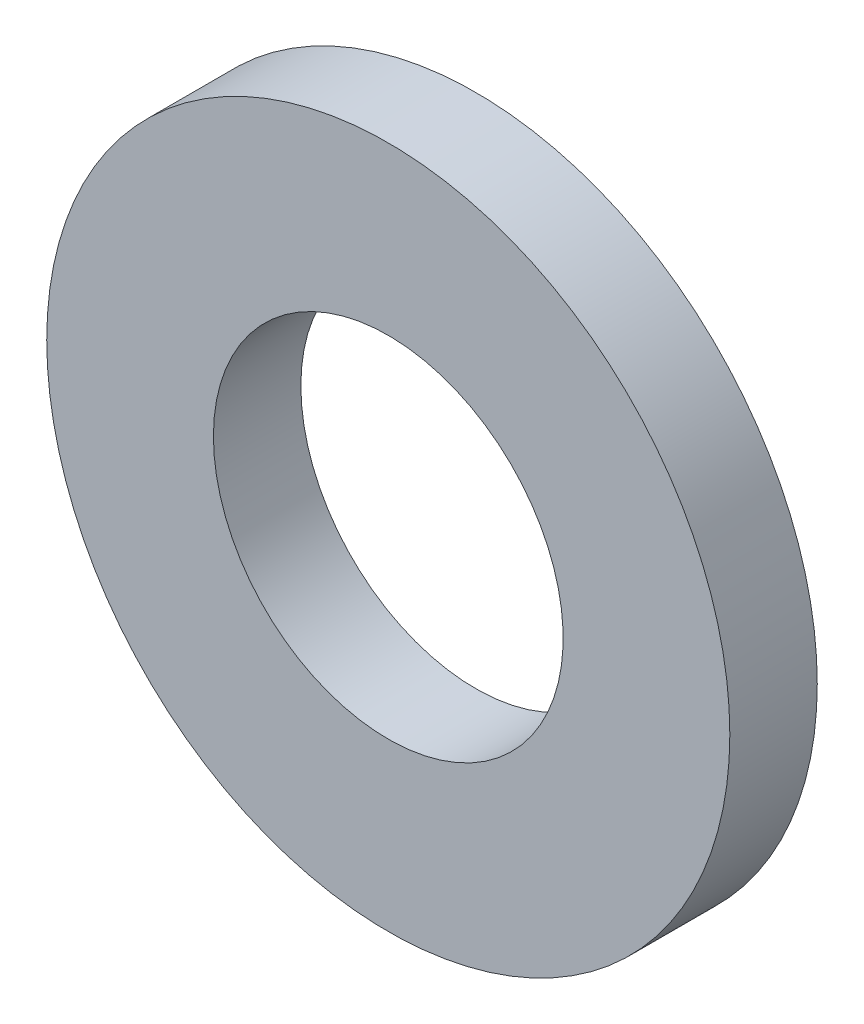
from build123d import *

# Parameters (mm, degrees)
SKETCH_1_R          = 6.25
EXTRUDE_256_DEPTH   = 1.6
SKETCH_2_R          = 3.2
CUT_EXTRUDE_1_DEPTH = 9.982482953


with BuildPart() as part:
    # Sketch 1 → Extrude 256 (new body)
    with BuildSketch(Plane.XY):
        Circle(SKETCH_1_R)
    extrude(amount=EXTRUDE_256_DEPTH)

    # Sketch 2 → Cut-Extrude 1 (cut, through all)
    with BuildSketch(Plane(origin=(0, 0, 0), x_dir=(-1, 0, 0), z_dir=(0, 0, -1))):
        Circle(SKETCH_2_R)
    extrude(amount=-CUT_EXTRUDE_1_DEPTH, mode=Mode.SUBTRACT)


solid = part.part
